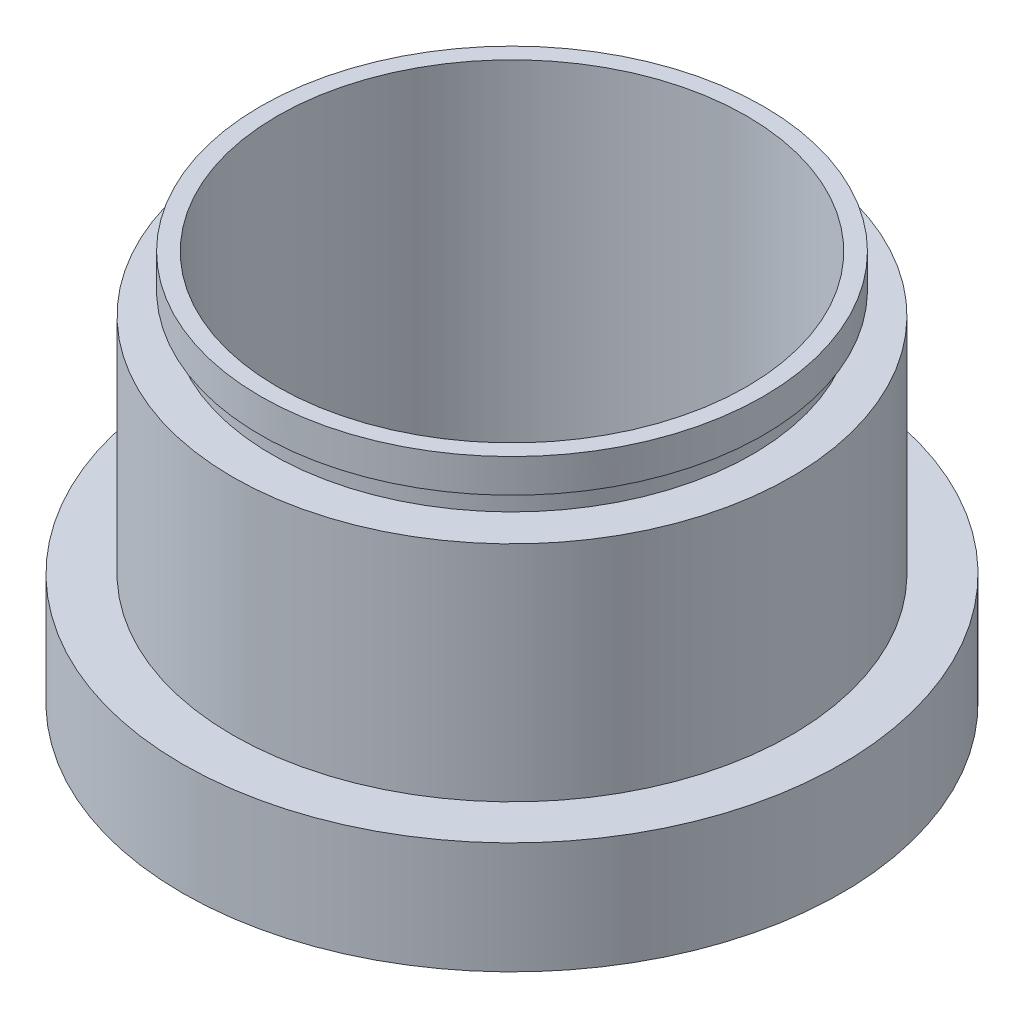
ISO-10303-21;
HEADER;
FILE_DESCRIPTION(('STEP AP214'),'2;1');
FILE_NAME('part.step','',(''),(''),'','','');
FILE_SCHEMA(('AUTOMOTIVE_DESIGN { 1 0 10303 214 1 1 1 1 }'));
ENDSEC;
DATA;
#1=APPLICATION_CONTEXT('core data for automotive mechanical design processes');
#2=APPLICATION_PROTOCOL_DEFINITION('international standard','automotive_design',2000,#1);
#3=PRODUCT_CONTEXT('',#1,'mechanical');
#4=PRODUCT('Part','Part','',(#3));
#5=PRODUCT_RELATED_PRODUCT_CATEGORY('part','',(#4));
#6=PRODUCT_DEFINITION_FORMATION('','',#4);
#7=PRODUCT_DEFINITION_CONTEXT('part definition',#1,'design');
#8=PRODUCT_DEFINITION('design','',#6,#7);
#9=PRODUCT_DEFINITION_SHAPE('','',#8);
#10=(LENGTH_UNIT() NAMED_UNIT(*) SI_UNIT(.MILLI.,.METRE.));
#11=(NAMED_UNIT(*) PLANE_ANGLE_UNIT() SI_UNIT($,.RADIAN.));
#12=(NAMED_UNIT(*) SI_UNIT($,.STERADIAN.) SOLID_ANGLE_UNIT());
#13=UNCERTAINTY_MEASURE_WITH_UNIT(LENGTH_MEASURE(1.E-05),#10,'distance_accuracy_value','');
#14=(GEOMETRIC_REPRESENTATION_CONTEXT(3) GLOBAL_UNCERTAINTY_ASSIGNED_CONTEXT((#13)) GLOBAL_UNIT_ASSIGNED_CONTEXT((#10,
#11,#12)) REPRESENTATION_CONTEXT('',''));
#15=CARTESIAN_POINT('',(0.,0.,0.));
#16=DIRECTION('',(0.,0.,1.));
#17=DIRECTION('',(1.,0.,0.));
#18=AXIS2_PLACEMENT_3D('',#15,#16,#17);
#19=CARTESIAN_POINT('',(0.,35.,0.));
#20=DIRECTION('',(0.,-1.,0.));
#21=DIRECTION('',(0.,0.,-1.));
#22=AXIS2_PLACEMENT_3D('',#19,#20,#21);
#23=CYLINDRICAL_SURFACE('',#22,22.5);
#24=CARTESIAN_POINT('',(0.,35.,0.));
#25=DIRECTION('',(0.,1.,0.));
#26=DIRECTION('',(0.,0.,1.));
#27=AXIS2_PLACEMENT_3D('',#24,#25,#26);
#28=CIRCLE('',#27,22.5);
#29=CARTESIAN_POINT('',(0.,35.,22.5));
#30=VERTEX_POINT('',#29);
#31=EDGE_CURVE('E46',#30,#30,#28,.T.);
#32=ORIENTED_EDGE('',*,*,#31,.F.);
#33=EDGE_LOOP('',(#32));
#34=FACE_BOUND('',#33,.T.);
#35=CARTESIAN_POINT('',(0.,32.,0.));
#36=DIRECTION('',(0.,-1.,0.));
#37=DIRECTION('',(0.,0.,-1.));
#38=AXIS2_PLACEMENT_3D('',#35,#36,#37);
#39=CIRCLE('',#38,22.5);
#40=CARTESIAN_POINT('',(0.,32.,-22.5));
#41=VERTEX_POINT('',#40);
#42=EDGE_CURVE('E55',#41,#41,#39,.T.);
#43=ORIENTED_EDGE('',*,*,#42,.F.);
#44=EDGE_LOOP('',(#43));
#45=FACE_BOUND('',#44,.T.);
#46=ADVANCED_FACE('F30',(#34,#45),#23,.T.);
#47=CARTESIAN_POINT('',(0.,30.,0.));
#48=DIRECTION('',(0.,1.,0.));
#49=DIRECTION('',(0.,0.,1.));
#50=AXIS2_PLACEMENT_3D('',#47,#48,#49);
#51=PLANE('',#50);
#52=CARTESIAN_POINT('',(0.,30.,0.));
#53=DIRECTION('',(0.,1.,0.));
#54=DIRECTION('',(0.,0.,1.));
#55=AXIS2_PLACEMENT_3D('',#52,#53,#54);
#56=CIRCLE('',#55,25.);
#57=CARTESIAN_POINT('',(0.,30.,25.));
#58=VERTEX_POINT('',#57);
#59=EDGE_CURVE('E41',#58,#58,#56,.T.);
#60=ORIENTED_EDGE('',*,*,#59,.T.);
#61=EDGE_LOOP('',(#60));
#62=FACE_BOUND('',#61,.T.);
#63=CARTESIAN_POINT('',(0.,30.,0.));
#64=DIRECTION('',(0.,-1.,0.));
#65=DIRECTION('',(0.,0.,-1.));
#66=AXIS2_PLACEMENT_3D('',#63,#64,#65);
#67=CIRCLE('',#66,21.5);
#68=CARTESIAN_POINT('',(0.,30.,-21.5));
#69=VERTEX_POINT('',#68);
#70=EDGE_CURVE('E63',#69,#69,#67,.T.);
#71=ORIENTED_EDGE('',*,*,#70,.T.);
#72=EDGE_LOOP('',(#71));
#73=FACE_BOUND('',#72,.T.);
#74=ADVANCED_FACE('F67',(#62,#73),#51,.T.);
#75=CARTESIAN_POINT('',(0.,10.,0.));
#76=DIRECTION('',(0.,1.,0.));
#77=DIRECTION('',(0.,0.,1.));
#78=AXIS2_PLACEMENT_3D('',#75,#76,#77);
#79=PLANE('',#78);
#80=CARTESIAN_POINT('',(0.,10.,0.));
#81=DIRECTION('',(0.,1.,0.));
#82=DIRECTION('',(0.,0.,1.));
#83=AXIS2_PLACEMENT_3D('',#80,#81,#82);
#84=CIRCLE('',#83,29.5);
#85=CARTESIAN_POINT('',(0.,10.,29.5));
#86=VERTEX_POINT('',#85);
#87=EDGE_CURVE('E10',#86,#86,#84,.T.);
#88=ORIENTED_EDGE('',*,*,#87,.T.);
#89=EDGE_LOOP('',(#88));
#90=FACE_BOUND('',#89,.T.);
#91=CARTESIAN_POINT('',(0.,10.,0.));
#92=DIRECTION('',(0.,1.,0.));
#93=DIRECTION('',(0.,0.,1.));
#94=AXIS2_PLACEMENT_3D('',#91,#92,#93);
#95=CIRCLE('',#94,25.);
#96=CARTESIAN_POINT('',(0.,10.,25.));
#97=VERTEX_POINT('',#96);
#98=EDGE_CURVE('E43',#97,#97,#95,.T.);
#99=ORIENTED_EDGE('',*,*,#98,.F.);
#100=EDGE_LOOP('',(#99));
#101=FACE_BOUND('',#100,.T.);
#102=ADVANCED_FACE('F86',(#90,#101),#79,.T.);
#103=CARTESIAN_POINT('',(0.,10.,0.));
#104=DIRECTION('',(0.,-1.,0.));
#105=DIRECTION('',(0.,0.,-1.));
#106=AXIS2_PLACEMENT_3D('',#103,#104,#105);
#107=CYLINDRICAL_SURFACE('',#106,29.5);
#108=ORIENTED_EDGE('',*,*,#87,.F.);
#109=EDGE_LOOP('',(#108));
#110=FACE_BOUND('',#109,.T.);
#111=CARTESIAN_POINT('',(0.,0.,0.));
#112=DIRECTION('',(0.,1.,0.));
#113=DIRECTION('',(0.,0.,1.));
#114=AXIS2_PLACEMENT_3D('',#111,#112,#113);
#115=CIRCLE('',#114,29.5);
#116=CARTESIAN_POINT('',(0.,0.,29.5));
#117=VERTEX_POINT('',#116);
#118=EDGE_CURVE('E34',#117,#117,#115,.T.);
#119=ORIENTED_EDGE('',*,*,#118,.T.);
#120=EDGE_LOOP('',(#119));
#121=FACE_BOUND('',#120,.T.);
#122=ADVANCED_FACE('F32',(#110,#121),#107,.T.);
#123=CARTESIAN_POINT('',(0.,0.,0.));
#124=DIRECTION('',(0.,1.,0.));
#125=DIRECTION('',(0.,0.,1.));
#126=AXIS2_PLACEMENT_3D('',#123,#124,#125);
#127=PLANE('',#126);
#128=CARTESIAN_POINT('',(0.,0.,0.));
#129=DIRECTION('',(0.,1.,0.));
#130=DIRECTION('',(0.,0.,1.));
#131=AXIS2_PLACEMENT_3D('',#128,#129,#130);
#132=CIRCLE('',#131,21.);
#133=CARTESIAN_POINT('',(0.,0.,21.));
#134=VERTEX_POINT('',#133);
#135=EDGE_CURVE('E51',#134,#134,#132,.T.);
#136=ORIENTED_EDGE('',*,*,#135,.T.);
#137=EDGE_LOOP('',(#136));
#138=FACE_BOUND('',#137,.T.);
#139=ORIENTED_EDGE('',*,*,#118,.F.);
#140=EDGE_LOOP('',(#139));
#141=FACE_BOUND('',#140,.T.);
#142=ADVANCED_FACE('F98',(#138,#141),#127,.F.);
#143=CARTESIAN_POINT('',(0.,30.,0.));
#144=DIRECTION('',(0.,-1.,0.));
#145=DIRECTION('',(0.,0.,-1.));
#146=AXIS2_PLACEMENT_3D('',#143,#144,#145);
#147=CYLINDRICAL_SURFACE('',#146,25.);
#148=ORIENTED_EDGE('',*,*,#59,.F.);
#149=EDGE_LOOP('',(#148));
#150=FACE_BOUND('',#149,.T.);
#151=ORIENTED_EDGE('',*,*,#98,.T.);
#152=EDGE_LOOP('',(#151));
#153=FACE_BOUND('',#152,.T.);
#154=ADVANCED_FACE('F95',(#150,#153),#147,.T.);
#155=CARTESIAN_POINT('',(0.,35.,0.));
#156=DIRECTION('',(0.,1.,0.));
#157=DIRECTION('',(0.,0.,1.));
#158=AXIS2_PLACEMENT_3D('',#155,#156,#157);
#159=PLANE('',#158);
#160=CARTESIAN_POINT('',(0.,35.,0.));
#161=DIRECTION('',(0.,1.,0.));
#162=DIRECTION('',(0.,0.,1.));
#163=AXIS2_PLACEMENT_3D('',#160,#161,#162);
#164=CIRCLE('',#163,21.);
#165=CARTESIAN_POINT('',(0.,35.,21.));
#166=VERTEX_POINT('',#165);
#167=EDGE_CURVE('E52',#166,#166,#164,.T.);
#168=ORIENTED_EDGE('',*,*,#167,.F.);
#169=EDGE_LOOP('',(#168));
#170=FACE_BOUND('',#169,.T.);
#171=ORIENTED_EDGE('',*,*,#31,.T.);
#172=EDGE_LOOP('',(#171));
#173=FACE_BOUND('',#172,.T.);
#174=ADVANCED_FACE('F92',(#170,#173),#159,.T.);
#175=CARTESIAN_POINT('',(0.,0.,0.));
#176=DIRECTION('',(0.,1.,0.));
#177=DIRECTION('',(0.,0.,1.));
#178=AXIS2_PLACEMENT_3D('',#175,#176,#177);
#179=CYLINDRICAL_SURFACE('',#178,21.);
#180=ORIENTED_EDGE('',*,*,#135,.F.);
#181=EDGE_LOOP('',(#180));
#182=FACE_BOUND('',#181,.T.);
#183=ORIENTED_EDGE('',*,*,#167,.T.);
#184=EDGE_LOOP('',(#183));
#185=FACE_BOUND('',#184,.T.);
#186=ADVANCED_FACE('F77',(#182,#185),#179,.F.);
#187=CARTESIAN_POINT('',(0.,32.,22.5));
#188=DIRECTION('',(0.,-1.,0.));
#189=DIRECTION('',(0.,0.,-1.));
#190=AXIS2_PLACEMENT_3D('',#187,#188,#189);
#191=PLANE('',#190);
#192=ORIENTED_EDGE('',*,*,#42,.T.);
#193=EDGE_LOOP('',(#192));
#194=FACE_BOUND('',#193,.T.);
#195=CARTESIAN_POINT('',(0.,32.,0.));
#196=DIRECTION('',(0.,-1.,0.));
#197=DIRECTION('',(0.,0.,-1.));
#198=AXIS2_PLACEMENT_3D('',#195,#196,#197);
#199=CIRCLE('',#198,21.5);
#200=CARTESIAN_POINT('',(0.,32.,-21.5));
#201=VERTEX_POINT('',#200);
#202=EDGE_CURVE('E60',#201,#201,#199,.T.);
#203=ORIENTED_EDGE('',*,*,#202,.F.);
#204=EDGE_LOOP('',(#203));
#205=FACE_BOUND('',#204,.T.);
#206=ADVANCED_FACE('F71',(#194,#205),#191,.T.);
#207=CARTESIAN_POINT('',(0.,0.,0.));
#208=DIRECTION('',(0.,-1.,0.));
#209=DIRECTION('',(0.,0.,-1.));
#210=AXIS2_PLACEMENT_3D('',#207,#208,#209);
#211=CYLINDRICAL_SURFACE('',#210,21.5);
#212=ORIENTED_EDGE('',*,*,#202,.T.);
#213=EDGE_LOOP('',(#212));
#214=FACE_BOUND('',#213,.T.);
#215=ORIENTED_EDGE('',*,*,#70,.F.);
#216=EDGE_LOOP('',(#215));
#217=FACE_BOUND('',#216,.T.);
#218=ADVANCED_FACE('F69',(#214,#217),#211,.T.);
#219=CLOSED_SHELL('',(#46,#74,#102,#122,#142,#154,#174,#186,#206,#218));
#220=MANIFOLD_SOLID_BREP('B2',#219);
#221=ADVANCED_BREP_SHAPE_REPRESENTATION('',(#18,#220),#14);
#222=SHAPE_DEFINITION_REPRESENTATION(#9,#221);
ENDSEC;
END-ISO-10303-21;
